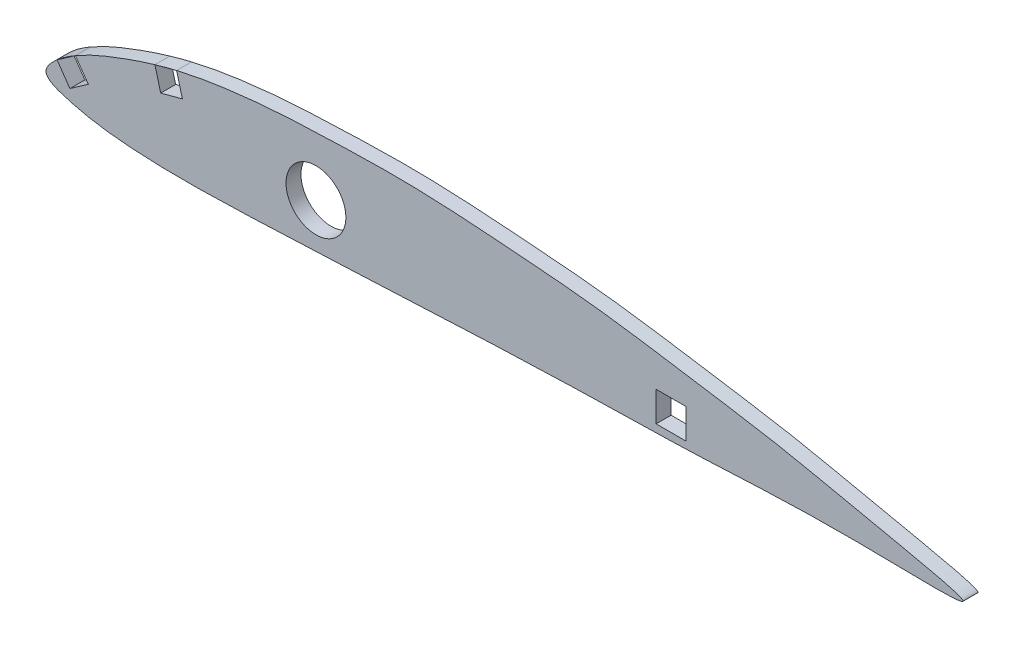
ISO-10303-21;
HEADER;
FILE_DESCRIPTION(('STEP AP214'),'2;1');
FILE_NAME('part.step','',(''),(''),'','','');
FILE_SCHEMA(('AUTOMOTIVE_DESIGN { 1 0 10303 214 1 1 1 1 }'));
ENDSEC;
DATA;
#1=APPLICATION_CONTEXT('core data for automotive mechanical design processes');
#2=APPLICATION_PROTOCOL_DEFINITION('international standard','automotive_design',2000,#1);
#3=PRODUCT_CONTEXT('',#1,'mechanical');
#4=PRODUCT('Part','Part','',(#3));
#5=PRODUCT_RELATED_PRODUCT_CATEGORY('part','',(#4));
#6=PRODUCT_DEFINITION_FORMATION('','',#4);
#7=PRODUCT_DEFINITION_CONTEXT('part definition',#1,'design');
#8=PRODUCT_DEFINITION('design','',#6,#7);
#9=PRODUCT_DEFINITION_SHAPE('','',#8);
#10=(LENGTH_UNIT() NAMED_UNIT(*) SI_UNIT(.MILLI.,.METRE.));
#11=(NAMED_UNIT(*) PLANE_ANGLE_UNIT() SI_UNIT($,.RADIAN.));
#12=(NAMED_UNIT(*) SI_UNIT($,.STERADIAN.) SOLID_ANGLE_UNIT());
#13=UNCERTAINTY_MEASURE_WITH_UNIT(LENGTH_MEASURE(1.E-05),#10,'distance_accuracy_value','');
#14=(GEOMETRIC_REPRESENTATION_CONTEXT(3) GLOBAL_UNCERTAINTY_ASSIGNED_CONTEXT((#13)) GLOBAL_UNIT_ASSIGNED_CONTEXT((#10,
#11,#12)) REPRESENTATION_CONTEXT('',''));
#15=CARTESIAN_POINT('',(0.,0.,0.));
#16=DIRECTION('',(0.,0.,1.));
#17=DIRECTION('',(1.,0.,0.));
#18=AXIS2_PLACEMENT_3D('',#15,#16,#17);
#19=CARTESIAN_POINT('',(0.,0.,0.));
#20=DIRECTION('',(0.,0.,-1.));
#21=DIRECTION('',(-1.,0.,0.));
#22=AXIS2_PLACEMENT_3D('',#19,#20,#21);
#23=PLANE('',#22);
#24=DIRECTION('',(0.,1.,0.));
#25=VECTOR('',#24,1.);
#26=CARTESIAN_POINT('',(129.417,0.,0.));
#27=LINE('',#26,#25);
#28=CARTESIAN_POINT('',(129.417,0.,0.));
#29=VERTEX_POINT('',#28);
#30=CARTESIAN_POINT('',(129.417,6.35,0.));
#31=VERTEX_POINT('',#30);
#32=EDGE_CURVE('E195',#29,#31,#27,.T.);
#33=ORIENTED_EDGE('',*,*,#32,.F.);
#34=DIRECTION('',(-1.,0.,0.));
#35=VECTOR('',#34,1.);
#36=CARTESIAN_POINT('',(0.,0.,0.));
#37=LINE('',#36,#35);
#38=CARTESIAN_POINT('',(135.767,0.,0.));
#39=VERTEX_POINT('',#38);
#40=EDGE_CURVE('E143',#39,#29,#37,.T.);
#41=ORIENTED_EDGE('',*,*,#40,.F.);
#42=DIRECTION('',(0.,-1.,0.));
#43=VECTOR('',#42,1.);
#44=CARTESIAN_POINT('',(135.767,0.,0.));
#45=LINE('',#44,#43);
#46=CARTESIAN_POINT('',(135.767,6.35,0.));
#47=VERTEX_POINT('',#46);
#48=EDGE_CURVE('E131',#47,#39,#45,.T.);
#49=ORIENTED_EDGE('',*,*,#48,.F.);
#50=DIRECTION('',(1.,0.,0.));
#51=VECTOR('',#50,1.);
#52=CARTESIAN_POINT('',(0.,6.35,0.));
#53=LINE('',#52,#51);
#54=EDGE_CURVE('E151',#31,#47,#53,.T.);
#55=ORIENTED_EDGE('',*,*,#54,.F.);
#56=EDGE_LOOP('',(#33,#41,#49,#55));
#57=FACE_BOUND('',#56,.T.);
#58=DIRECTION('',(-0.573576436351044,0.819152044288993,0.));
#59=VECTOR('',#58,1.);
#60=CARTESIAN_POINT('',(3.13682600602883,2.19642921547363,0.));
#61=LINE('',#60,#59);
#62=CARTESIAN_POINT('',(5.07592847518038,-0.572896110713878,0.));
#63=VERTEX_POINT('',#62);
#64=CARTESIAN_POINT('',(2.34427069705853,3.32831550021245,0.));
#65=VERTEX_POINT('',#64);
#66=EDGE_CURVE('E157',#63,#65,#61,.T.);
#67=ORIENTED_EDGE('',*,*,#66,.F.);
#68=DIRECTION('',(-0.819152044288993,-0.573576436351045,0.));
#69=VECTOR('',#68,1.);
#70=CARTESIAN_POINT('',(1.93910246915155,-2.76932532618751,0.));
#71=LINE('',#70,#69);
#72=CARTESIAN_POINT('',(8.97714008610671,2.15876166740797,0.));
#73=VERTEX_POINT('',#72);
#74=EDGE_CURVE('E214',#73,#63,#71,.T.);
#75=ORIENTED_EDGE('',*,*,#74,.F.);
#76=DIRECTION('',(0.573576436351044,-0.819152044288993,0.));
#77=VECTOR('',#76,1.);
#78=CARTESIAN_POINT('',(7.03803761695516,4.92808699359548,0.));
#79=LINE('',#78,#77);
#80=CARTESIAN_POINT('',(6.24548230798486,6.0599732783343,0.));
#81=VERTEX_POINT('',#80);
#82=EDGE_CURVE('E224',#81,#73,#79,.T.);
#83=ORIENTED_EDGE('',*,*,#82,.F.);
#84=CARTESIAN_POINT('',(0.,0.,0.));
#85=CARTESIAN_POINT('',(-0.0535910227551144,1.04071019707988,0.));
#86=CARTESIAN_POINT('',(2.21891608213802,3.37690956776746,0.));
#87=CARTESIAN_POINT('',(5.44657776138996,5.68858581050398,0.));
#88=CARTESIAN_POINT('',(9.62986761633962,7.94124910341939,0.));
#89=CARTESIAN_POINT('',(17.6410211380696,11.1999584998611,0.));
#90=CARTESIAN_POINT('',(27.3590244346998,14.3005312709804,0.));
#91=CARTESIAN_POINT('',(38.8623910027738,16.1401228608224,0.));
#92=CARTESIAN_POINT('',(48.6121616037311,17.1131172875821,0.));
#93=CARTESIAN_POINT('',(61.5900604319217,17.6570218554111,0.));
#94=CARTESIAN_POINT('',(77.8287615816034,18.1175977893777,0.));
#95=CARTESIAN_POINT('',(97.2641868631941,16.7535368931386,0.));
#96=CARTESIAN_POINT('',(116.839934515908,15.228196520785,0.));
#97=CARTESIAN_POINT('',(135.97149229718,12.1634671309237,0.));
#98=CARTESIAN_POINT('',(156.494479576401,9.02600517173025,0.));
#99=CARTESIAN_POINT('',(172.156869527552,5.3413479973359,0.));
#100=CARTESIAN_POINT('',(205.497045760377,-1.26273643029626,0.));
#101=CARTESIAN_POINT('',(162.35826929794,0.256714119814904,0.));
#102=CARTESIAN_POINT('',(143.598235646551,-1.46012727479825,0.));
#103=CARTESIAN_POINT('',(103.100380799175,-2.09853076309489,0.));
#104=CARTESIAN_POINT('',(71.4433442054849,-3.82348710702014,0.));
#105=CARTESIAN_POINT('',(38.8496116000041,-5.24421717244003,0.));
#106=CARTESIAN_POINT('',(22.8315334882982,-5.50686856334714,0.));
#107=CARTESIAN_POINT('',(11.0414504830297,-4.36496331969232,0.));
#108=CARTESIAN_POINT('',(5.03929600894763,-2.99257497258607,0.));
#109=CARTESIAN_POINT('',(0.0735408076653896,-1.42812479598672,0.));
#110=CARTESIAN_POINT('',(0.,0.,0.));
#111=B_SPLINE_CURVE_WITH_KNOTS('',3,(#84,#85,#86,#87,#88,#89,#90,#91,#92,#93,#94,#95,#96,#97,
#98,#99,#100,#101,#102,#103,#104,#105,#106,#107,#108,#109,#110),.UNSPECIFIED.,.T.,.F.,(4,1,1,1,
1,1,1,1,1,1,1,1,1,1,1,1,1,1,1,1,1,1,1,1,4),(0.,0.0105604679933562,0.0182111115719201,
0.0322098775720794,0.0455249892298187,0.0840694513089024,0.10897429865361,0.133649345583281,
0.158232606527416,0.207343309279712,0.25652270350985,0.30582635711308,0.355445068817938,
0.40521420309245,0.4553904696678,0.506006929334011,0.555121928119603,0.653369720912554,
0.702490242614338,0.849938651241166,0.899083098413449,0.948194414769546,0.972905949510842,
0.985508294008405,1.),.UNSPECIFIED.);
#112=CARTESIAN_POINT('',(23.0999646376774,12.8209989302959,0.));
#113=VERTEX_POINT('',#112);
#114=EDGE_CURVE('E170',#81,#113,#111,.T.);
#115=ORIENTED_EDGE('',*,*,#114,.T.);
#116=DIRECTION('',(-0.258819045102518,0.965925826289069,0.));
#117=VECTOR('',#116,1.);
#118=CARTESIAN_POINT('',(24.7578101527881,6.63383523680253,0.));
#119=LINE('',#118,#117);
#120=CARTESIAN_POINT('',(24.3325903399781,8.22077718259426,0.));
#121=VERTEX_POINT('',#120);
#122=EDGE_CURVE('E206',#121,#113,#119,.T.);
#123=ORIENTED_EDGE('',*,*,#122,.F.);
#124=DIRECTION('',(-0.965925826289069,-0.258819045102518,0.));
#125=VECTOR('',#124,1.);
#126=CARTESIAN_POINT('',(-0.42521981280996,1.58694194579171,0.));
#127=LINE('',#126,#125);
#128=CARTESIAN_POINT('',(28.9328120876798,9.453402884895,0.));
#129=VERTEX_POINT('',#128);
#130=EDGE_CURVE('E218',#129,#121,#127,.T.);
#131=ORIENTED_EDGE('',*,*,#130,.F.);
#132=DIRECTION('',(0.258819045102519,-0.965925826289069,0.));
#133=VECTOR('',#132,1.);
#134=CARTESIAN_POINT('',(29.3580319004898,7.86646093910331,0.));
#135=LINE('',#134,#133);
#136=CARTESIAN_POINT('',(27.7001863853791,14.0536246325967,0.));
#137=VERTEX_POINT('',#136);
#138=EDGE_CURVE('E228',#137,#129,#135,.T.);
#139=ORIENTED_EDGE('',*,*,#138,.F.);
#140=EDGE_CURVE('E163',#137,#65,#111,.T.);
#141=ORIENTED_EDGE('',*,*,#140,.T.);
#142=EDGE_LOOP('',(#67,#75,#83,#115,#123,#131,#139,#141));
#143=FACE_BOUND('',#142,.T.);
#144=CARTESIAN_POINT('',(57.26,5.,0.));
#145=DIRECTION('',(0.,0.,-1.));
#146=DIRECTION('',(-1.,0.,0.));
#147=AXIS2_PLACEMENT_3D('',#144,#145,#146);
#148=CIRCLE('',#147,6.35);
#149=CARTESIAN_POINT('',(50.91,5.,0.));
#150=VERTEX_POINT('',#149);
#151=EDGE_CURVE('E201',#150,#150,#148,.T.);
#152=ORIENTED_EDGE('',*,*,#151,.F.);
#153=EDGE_LOOP('',(#152));
#154=FACE_BOUND('',#153,.T.);
#155=ADVANCED_FACE('F44',(#57,#143,#154),#23,.T.);
#156=CARTESIAN_POINT('',(0.,0.,3.175));
#157=DIRECTION('',(0.,0.,-1.));
#158=DIRECTION('',(-1.,0.,0.));
#159=AXIS2_PLACEMENT_3D('',#156,#157,#158);
#160=PLANE('',#159);
#161=DIRECTION('',(1.,0.,0.));
#162=VECTOR('',#161,1.);
#163=CARTESIAN_POINT('',(129.417,0.,3.175));
#164=LINE('',#163,#162);
#165=CARTESIAN_POINT('',(129.417,0.,3.175));
#166=VERTEX_POINT('',#165);
#167=CARTESIAN_POINT('',(135.767,0.,3.175));
#168=VERTEX_POINT('',#167);
#169=EDGE_CURVE('E13',#166,#168,#164,.T.);
#170=ORIENTED_EDGE('',*,*,#169,.F.);
#171=DIRECTION('',(0.,-1.,0.));
#172=VECTOR('',#171,1.);
#173=CARTESIAN_POINT('',(129.417,6.35,3.175));
#174=LINE('',#173,#172);
#175=CARTESIAN_POINT('',(129.417,6.35,3.175));
#176=VERTEX_POINT('',#175);
#177=EDGE_CURVE('E149',#176,#166,#174,.T.);
#178=ORIENTED_EDGE('',*,*,#177,.F.);
#179=DIRECTION('',(-1.,0.,0.));
#180=VECTOR('',#179,1.);
#181=CARTESIAN_POINT('',(129.417,6.35,3.175));
#182=LINE('',#181,#180);
#183=CARTESIAN_POINT('',(135.767,6.35,3.175));
#184=VERTEX_POINT('',#183);
#185=EDGE_CURVE('E142',#184,#176,#182,.T.);
#186=ORIENTED_EDGE('',*,*,#185,.F.);
#187=DIRECTION('',(0.,1.,0.));
#188=VECTOR('',#187,1.);
#189=CARTESIAN_POINT('',(135.767,6.35,3.175));
#190=LINE('',#189,#188);
#191=EDGE_CURVE('E128',#168,#184,#190,.T.);
#192=ORIENTED_EDGE('',*,*,#191,.F.);
#193=EDGE_LOOP('',(#170,#178,#186,#192));
#194=FACE_BOUND('',#193,.T.);
#195=CARTESIAN_POINT('',(57.26,5.,3.175));
#196=DIRECTION('',(0.,0.,1.));
#197=DIRECTION('',(1.,0.,0.));
#198=AXIS2_PLACEMENT_3D('',#195,#196,#197);
#199=CIRCLE('',#198,6.35);
#200=CARTESIAN_POINT('',(63.61,5.,3.175));
#201=VERTEX_POINT('',#200);
#202=EDGE_CURVE('E203',#201,#201,#199,.T.);
#203=ORIENTED_EDGE('',*,*,#202,.F.);
#204=EDGE_LOOP('',(#203));
#205=FACE_BOUND('',#204,.T.);
#206=DIRECTION('',(0.819152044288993,0.573576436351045,0.));
#207=VECTOR('',#206,1.);
#208=CARTESIAN_POINT('',(5.07592847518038,-0.572896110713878,3.175));
#209=LINE('',#208,#207);
#210=CARTESIAN_POINT('',(5.07592847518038,-0.572896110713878,3.175));
#211=VERTEX_POINT('',#210);
#212=CARTESIAN_POINT('',(8.97714008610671,2.15876166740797,3.175));
#213=VERTEX_POINT('',#212);
#214=EDGE_CURVE('E211',#211,#213,#209,.T.);
#215=ORIENTED_EDGE('',*,*,#214,.F.);
#216=DIRECTION('',(0.573576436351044,-0.819152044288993,0.));
#217=VECTOR('',#216,1.);
#218=CARTESIAN_POINT('',(2.34427069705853,3.32831550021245,3.175));
#219=LINE('',#218,#217);
#220=CARTESIAN_POINT('',(2.34427069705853,3.32831550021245,3.175));
#221=VERTEX_POINT('',#220);
#222=EDGE_CURVE('E156',#221,#211,#219,.T.);
#223=ORIENTED_EDGE('',*,*,#222,.F.);
#224=CARTESIAN_POINT('',(0.,0.,3.175));
#225=CARTESIAN_POINT('',(-0.0535910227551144,1.04071019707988,3.175));
#226=CARTESIAN_POINT('',(2.21891608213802,3.37690956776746,3.175));
#227=CARTESIAN_POINT('',(5.44657776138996,5.68858581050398,3.175));
#228=CARTESIAN_POINT('',(9.62986761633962,7.94124910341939,3.175));
#229=CARTESIAN_POINT('',(17.6410211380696,11.1999584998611,3.175));
#230=CARTESIAN_POINT('',(27.3590244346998,14.3005312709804,3.175));
#231=CARTESIAN_POINT('',(38.8623910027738,16.1401228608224,3.175));
#232=CARTESIAN_POINT('',(48.6121616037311,17.1131172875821,3.175));
#233=CARTESIAN_POINT('',(61.5900604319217,17.6570218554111,3.175));
#234=CARTESIAN_POINT('',(77.8287615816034,18.1175977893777,3.175));
#235=CARTESIAN_POINT('',(97.2641868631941,16.7535368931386,3.175));
#236=CARTESIAN_POINT('',(116.839934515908,15.228196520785,3.175));
#237=CARTESIAN_POINT('',(135.97149229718,12.1634671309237,3.175));
#238=CARTESIAN_POINT('',(156.494479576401,9.02600517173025,3.175));
#239=CARTESIAN_POINT('',(172.156869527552,5.3413479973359,3.175));
#240=CARTESIAN_POINT('',(205.497045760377,-1.26273643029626,3.175));
#241=CARTESIAN_POINT('',(162.35826929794,0.256714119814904,3.175));
#242=CARTESIAN_POINT('',(143.598235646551,-1.46012727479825,3.175));
#243=CARTESIAN_POINT('',(103.100380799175,-2.09853076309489,3.175));
#244=CARTESIAN_POINT('',(71.4433442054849,-3.82348710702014,3.175));
#245=CARTESIAN_POINT('',(38.8496116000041,-5.24421717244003,3.175));
#246=CARTESIAN_POINT('',(22.8315334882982,-5.50686856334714,3.175));
#247=CARTESIAN_POINT('',(11.0414504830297,-4.36496331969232,3.175));
#248=CARTESIAN_POINT('',(5.03929600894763,-2.99257497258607,3.175));
#249=CARTESIAN_POINT('',(0.0735408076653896,-1.42812479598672,3.175));
#250=CARTESIAN_POINT('',(0.,0.,3.175));
#251=B_SPLINE_CURVE_WITH_KNOTS('',3,(#224,#225,#226,#227,#228,#229,#230,#231,#232,#233,#234,
#235,#236,#237,#238,#239,#240,#241,#242,#243,#244,#245,#246,#247,#248,#249,#250),.UNSPECIFIED.,
.T.,.F.,(4,1,1,1,1,1,1,1,1,1,1,1,1,1,1,1,1,1,1,1,1,1,1,1,4),(0.,0.0105604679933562,
0.0182111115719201,0.0322098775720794,0.0455249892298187,0.0840694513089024,0.10897429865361,
0.133649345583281,0.158232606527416,0.207343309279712,0.25652270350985,0.30582635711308,
0.355445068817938,0.40521420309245,0.4553904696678,0.506006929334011,0.555121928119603,
0.653369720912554,0.702490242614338,0.849938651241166,0.899083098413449,0.948194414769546,
0.972905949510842,0.985508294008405,1.),.UNSPECIFIED.);
#252=CARTESIAN_POINT('',(27.7001863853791,14.0536246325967,3.175));
#253=VERTEX_POINT('',#252);
#254=EDGE_CURVE('E162',#253,#221,#251,.T.);
#255=ORIENTED_EDGE('',*,*,#254,.F.);
#256=DIRECTION('',(-0.258819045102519,0.965925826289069,0.));
#257=VECTOR('',#256,1.);
#258=CARTESIAN_POINT('',(27.7001863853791,14.0536246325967,3.175));
#259=LINE('',#258,#257);
#260=CARTESIAN_POINT('',(28.9328120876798,9.453402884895,3.175));
#261=VERTEX_POINT('',#260);
#262=EDGE_CURVE('E221',#261,#253,#259,.T.);
#263=ORIENTED_EDGE('',*,*,#262,.F.);
#264=DIRECTION('',(0.965925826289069,0.258819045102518,0.));
#265=VECTOR('',#264,1.);
#266=CARTESIAN_POINT('',(24.3325903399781,8.22077718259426,3.175));
#267=LINE('',#266,#265);
#268=CARTESIAN_POINT('',(24.3325903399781,8.22077718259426,3.175));
#269=VERTEX_POINT('',#268);
#270=EDGE_CURVE('E223',#269,#261,#267,.T.);
#271=ORIENTED_EDGE('',*,*,#270,.F.);
#272=DIRECTION('',(0.258819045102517,-0.965925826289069,0.));
#273=VECTOR('',#272,1.);
#274=CARTESIAN_POINT('',(23.0999646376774,12.8209989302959,3.175));
#275=LINE('',#274,#273);
#276=CARTESIAN_POINT('',(23.0999646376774,12.8209989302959,3.175));
#277=VERTEX_POINT('',#276);
#278=EDGE_CURVE('E231',#277,#269,#275,.T.);
#279=ORIENTED_EDGE('',*,*,#278,.F.);
#280=CARTESIAN_POINT('',(6.24548232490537,6.05997328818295,3.175));
#281=VERTEX_POINT('',#280);
#282=EDGE_CURVE('E161',#281,#277,#251,.T.);
#283=ORIENTED_EDGE('',*,*,#282,.F.);
#284=DIRECTION('',(-0.573576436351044,0.819152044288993,0.));
#285=VECTOR('',#284,1.);
#286=CARTESIAN_POINT('',(6.24548230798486,6.0599732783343,3.175));
#287=LINE('',#286,#285);
#288=EDGE_CURVE('E217',#213,#281,#287,.T.);
#289=ORIENTED_EDGE('',*,*,#288,.F.);
#290=EDGE_LOOP('',(#215,#223,#255,#263,#271,#279,#283,#289));
#291=FACE_BOUND('',#290,.T.);
#292=ADVANCED_FACE('F140',(#194,#205,#291),#160,.F.);
#293=DIRECTION('',(0.,0.,1.));
#294=VECTOR('',#293,1.);
#295=SURFACE_OF_LINEAR_EXTRUSION('',#111,#294);
#296=DIRECTION('',(0.,0.,1.));
#297=VECTOR('',#296,1.);
#298=CARTESIAN_POINT('',(2.34427069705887,3.32831550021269,0.));
#299=LINE('',#298,#297);
#300=EDGE_CURVE('E153',#65,#221,#299,.T.);
#301=ORIENTED_EDGE('',*,*,#300,.F.);
#302=ORIENTED_EDGE('',*,*,#140,.F.);
#303=DIRECTION('',(0.,0.,1.));
#304=VECTOR('',#303,1.);
#305=CARTESIAN_POINT('',(27.7001863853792,14.0536246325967,0.));
#306=LINE('',#305,#304);
#307=EDGE_CURVE('E169',#137,#253,#306,.T.);
#308=ORIENTED_EDGE('',*,*,#307,.T.);
#309=ORIENTED_EDGE('',*,*,#254,.T.);
#310=EDGE_LOOP('',(#301,#302,#308,#309));
#311=FACE_BOUND('',#310,.T.);
#312=ADVANCED_FACE('F179',(#311),#295,.F.);
#313=ORIENTED_EDGE('',*,*,#114,.F.);
#314=DIRECTION('',(0.,0.,1.));
#315=VECTOR('',#314,1.);
#316=CARTESIAN_POINT('',(6.24548230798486,6.0599732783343,0.));
#317=LINE('',#316,#315);
#318=EDGE_CURVE('E158',#81,#281,#317,.T.);
#319=ORIENTED_EDGE('',*,*,#318,.T.);
#320=ORIENTED_EDGE('',*,*,#282,.T.);
#321=DIRECTION('',(0.,0.,1.));
#322=VECTOR('',#321,1.);
#323=CARTESIAN_POINT('',(23.0999646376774,12.8209989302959,0.));
#324=LINE('',#323,#322);
#325=EDGE_CURVE('E47',#113,#277,#324,.T.);
#326=ORIENTED_EDGE('',*,*,#325,.F.);
#327=EDGE_LOOP('',(#313,#319,#320,#326));
#328=FACE_BOUND('',#327,.T.);
#329=ADVANCED_FACE('F175',(#328),#295,.F.);
#330=CARTESIAN_POINT('',(57.26,5.,-6.825));
#331=DIRECTION('',(0.,0.,1.));
#332=DIRECTION('',(1.,0.,0.));
#333=AXIS2_PLACEMENT_3D('',#330,#331,#332);
#334=CYLINDRICAL_SURFACE('',#333,6.35);
#335=ORIENTED_EDGE('',*,*,#151,.T.);
#336=EDGE_LOOP('',(#335));
#337=FACE_BOUND('',#336,.T.);
#338=ORIENTED_EDGE('',*,*,#202,.T.);
#339=EDGE_LOOP('',(#338));
#340=FACE_BOUND('',#339,.T.);
#341=ADVANCED_FACE('F178',(#337,#340),#334,.F.);
#342=CARTESIAN_POINT('',(23.0999646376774,12.8209989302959,-6.825));
#343=DIRECTION('',(-0.965925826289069,-0.258819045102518,0.));
#344=DIRECTION('',(0.258819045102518,-0.965925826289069,0.));
#345=AXIS2_PLACEMENT_3D('',#342,#343,#344);
#346=PLANE('',#345);
#347=ORIENTED_EDGE('',*,*,#122,.T.);
#348=ORIENTED_EDGE('',*,*,#325,.T.);
#349=ORIENTED_EDGE('',*,*,#278,.T.);
#350=DIRECTION('',(0.,0.,1.));
#351=VECTOR('',#350,1.);
#352=CARTESIAN_POINT('',(24.3325903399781,8.22077718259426,-6.825));
#353=LINE('',#352,#351);
#354=EDGE_CURVE('E220',#121,#269,#353,.T.);
#355=ORIENTED_EDGE('',*,*,#354,.F.);
#356=EDGE_LOOP('',(#347,#348,#349,#355));
#357=FACE_BOUND('',#356,.T.);
#358=ADVANCED_FACE('F324',(#357),#346,.F.);
#359=CARTESIAN_POINT('',(27.7001863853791,14.0536246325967,-6.825));
#360=DIRECTION('',(0.965925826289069,0.258819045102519,0.));
#361=DIRECTION('',(-0.258819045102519,0.965925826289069,0.));
#362=AXIS2_PLACEMENT_3D('',#359,#360,#361);
#363=PLANE('',#362);
#364=ORIENTED_EDGE('',*,*,#138,.T.);
#365=DIRECTION('',(0.,0.,1.));
#366=VECTOR('',#365,1.);
#367=CARTESIAN_POINT('',(28.9328120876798,9.453402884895,-6.825));
#368=LINE('',#367,#366);
#369=EDGE_CURVE('E230',#129,#261,#368,.T.);
#370=ORIENTED_EDGE('',*,*,#369,.T.);
#371=ORIENTED_EDGE('',*,*,#262,.T.);
#372=ORIENTED_EDGE('',*,*,#307,.F.);
#373=EDGE_LOOP('',(#364,#370,#371,#372));
#374=FACE_BOUND('',#373,.T.);
#375=ADVANCED_FACE('F314',(#374),#363,.F.);
#376=CARTESIAN_POINT('',(24.3325903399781,8.22077718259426,-6.825));
#377=DIRECTION('',(0.258819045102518,-0.965925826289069,0.));
#378=DIRECTION('',(0.965925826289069,0.258819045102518,0.));
#379=AXIS2_PLACEMENT_3D('',#376,#377,#378);
#380=PLANE('',#379);
#381=ORIENTED_EDGE('',*,*,#130,.T.);
#382=ORIENTED_EDGE('',*,*,#354,.T.);
#383=ORIENTED_EDGE('',*,*,#270,.T.);
#384=ORIENTED_EDGE('',*,*,#369,.F.);
#385=EDGE_LOOP('',(#381,#382,#383,#384));
#386=FACE_BOUND('',#385,.T.);
#387=ADVANCED_FACE('F304',(#386),#380,.F.);
#388=CARTESIAN_POINT('',(2.34427069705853,3.32831550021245,-6.825));
#389=DIRECTION('',(-0.819152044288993,-0.573576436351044,0.));
#390=DIRECTION('',(0.573576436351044,-0.819152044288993,0.));
#391=AXIS2_PLACEMENT_3D('',#388,#389,#390);
#392=PLANE('',#391);
#393=ORIENTED_EDGE('',*,*,#66,.T.);
#394=ORIENTED_EDGE('',*,*,#300,.T.);
#395=ORIENTED_EDGE('',*,*,#222,.T.);
#396=DIRECTION('',(0.,0.,1.));
#397=VECTOR('',#396,1.);
#398=CARTESIAN_POINT('',(5.07592847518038,-0.572896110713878,-6.825));
#399=LINE('',#398,#397);
#400=EDGE_CURVE('E216',#63,#211,#399,.T.);
#401=ORIENTED_EDGE('',*,*,#400,.F.);
#402=EDGE_LOOP('',(#393,#394,#395,#401));
#403=FACE_BOUND('',#402,.T.);
#404=ADVANCED_FACE('F295',(#403),#392,.F.);
#405=CARTESIAN_POINT('',(6.24548230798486,6.0599732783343,-6.825));
#406=DIRECTION('',(0.819152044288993,0.573576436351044,0.));
#407=DIRECTION('',(-0.573576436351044,0.819152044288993,0.));
#408=AXIS2_PLACEMENT_3D('',#405,#406,#407);
#409=PLANE('',#408);
#410=ORIENTED_EDGE('',*,*,#82,.T.);
#411=DIRECTION('',(0.,0.,1.));
#412=VECTOR('',#411,1.);
#413=CARTESIAN_POINT('',(8.97714008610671,2.15876166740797,-6.825));
#414=LINE('',#413,#412);
#415=EDGE_CURVE('E226',#73,#213,#414,.T.);
#416=ORIENTED_EDGE('',*,*,#415,.T.);
#417=ORIENTED_EDGE('',*,*,#288,.T.);
#418=ORIENTED_EDGE('',*,*,#318,.F.);
#419=EDGE_LOOP('',(#410,#416,#417,#418));
#420=FACE_BOUND('',#419,.T.);
#421=ADVANCED_FACE('F260',(#420),#409,.F.);
#422=CARTESIAN_POINT('',(5.07592847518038,-0.572896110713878,-6.825));
#423=DIRECTION('',(0.573576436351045,-0.819152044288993,0.));
#424=DIRECTION('',(0.819152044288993,0.573576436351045,0.));
#425=AXIS2_PLACEMENT_3D('',#422,#423,#424);
#426=PLANE('',#425);
#427=ORIENTED_EDGE('',*,*,#74,.T.);
#428=ORIENTED_EDGE('',*,*,#400,.T.);
#429=ORIENTED_EDGE('',*,*,#214,.T.);
#430=ORIENTED_EDGE('',*,*,#415,.F.);
#431=EDGE_LOOP('',(#427,#428,#429,#430));
#432=FACE_BOUND('',#431,.T.);
#433=ADVANCED_FACE('F255',(#432),#426,.F.);
#434=CARTESIAN_POINT('',(129.417,6.35,-6.825));
#435=DIRECTION('',(-1.,0.,0.));
#436=DIRECTION('',(0.,0.,1.));
#437=AXIS2_PLACEMENT_3D('',#434,#435,#436);
#438=PLANE('',#437);
#439=ORIENTED_EDGE('',*,*,#32,.T.);
#440=DIRECTION('',(0.,0.,1.));
#441=VECTOR('',#440,1.);
#442=CARTESIAN_POINT('',(129.417,6.35,-6.825));
#443=LINE('',#442,#441);
#444=EDGE_CURVE('E152',#31,#176,#443,.T.);
#445=ORIENTED_EDGE('',*,*,#444,.T.);
#446=ORIENTED_EDGE('',*,*,#177,.T.);
#447=DIRECTION('',(0.,0.,1.));
#448=VECTOR('',#447,1.);
#449=CARTESIAN_POINT('',(129.417,0.,-6.825));
#450=LINE('',#449,#448);
#451=EDGE_CURVE('E53',#29,#166,#450,.T.);
#452=ORIENTED_EDGE('',*,*,#451,.F.);
#453=EDGE_LOOP('',(#439,#445,#446,#452));
#454=FACE_BOUND('',#453,.T.);
#455=ADVANCED_FACE('F249',(#454),#438,.F.);
#456=CARTESIAN_POINT('',(129.417,6.35,-6.825));
#457=DIRECTION('',(0.,1.,0.));
#458=DIRECTION('',(0.,0.,1.));
#459=AXIS2_PLACEMENT_3D('',#456,#457,#458);
#460=PLANE('',#459);
#461=ORIENTED_EDGE('',*,*,#54,.T.);
#462=DIRECTION('',(0.,0.,1.));
#463=VECTOR('',#462,1.);
#464=CARTESIAN_POINT('',(135.767,6.35,-6.825));
#465=LINE('',#464,#463);
#466=EDGE_CURVE('E123',#47,#184,#465,.T.);
#467=ORIENTED_EDGE('',*,*,#466,.T.);
#468=ORIENTED_EDGE('',*,*,#185,.T.);
#469=ORIENTED_EDGE('',*,*,#444,.F.);
#470=EDGE_LOOP('',(#461,#467,#468,#469));
#471=FACE_BOUND('',#470,.T.);
#472=ADVANCED_FACE('F181',(#471),#460,.F.);
#473=CARTESIAN_POINT('',(135.767,6.35,-6.825));
#474=DIRECTION('',(1.,0.,0.));
#475=DIRECTION('',(0.,0.,-1.));
#476=AXIS2_PLACEMENT_3D('',#473,#474,#475);
#477=PLANE('',#476);
#478=ORIENTED_EDGE('',*,*,#48,.T.);
#479=DIRECTION('',(0.,0.,1.));
#480=VECTOR('',#479,1.);
#481=CARTESIAN_POINT('',(135.767,0.,-6.825));
#482=LINE('',#481,#480);
#483=EDGE_CURVE('E61',#39,#168,#482,.T.);
#484=ORIENTED_EDGE('',*,*,#483,.T.);
#485=ORIENTED_EDGE('',*,*,#191,.T.);
#486=ORIENTED_EDGE('',*,*,#466,.F.);
#487=EDGE_LOOP('',(#478,#484,#485,#486));
#488=FACE_BOUND('',#487,.T.);
#489=ADVANCED_FACE('F126',(#488),#477,.F.);
#490=CARTESIAN_POINT('',(129.417,0.,-6.825));
#491=DIRECTION('',(0.,-1.,0.));
#492=DIRECTION('',(0.,0.,-1.));
#493=AXIS2_PLACEMENT_3D('',#490,#491,#492);
#494=PLANE('',#493);
#495=ORIENTED_EDGE('',*,*,#40,.T.);
#496=ORIENTED_EDGE('',*,*,#451,.T.);
#497=ORIENTED_EDGE('',*,*,#169,.T.);
#498=ORIENTED_EDGE('',*,*,#483,.F.);
#499=EDGE_LOOP('',(#495,#496,#497,#498));
#500=FACE_BOUND('',#499,.T.);
#501=ADVANCED_FACE('F136',(#500),#494,.F.);
#502=CLOSED_SHELL('',(#155,#292,#312,#329,#341,#358,#375,#387,#404,#421,#433,#455,#472,#489,#501));
#503=MANIFOLD_SOLID_BREP('B2',#502);
#504=CARTESIAN_POINT('',(0.,0.,0.));
#505=CARTESIAN_POINT('',(-0.0535910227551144,1.04071019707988,0.));
#506=CARTESIAN_POINT('',(2.21891608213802,3.37690956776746,0.));
#507=CARTESIAN_POINT('',(5.44657776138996,5.68858581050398,0.));
#508=CARTESIAN_POINT('',(9.62986761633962,7.94124910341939,0.));
#509=CARTESIAN_POINT('',(17.6410211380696,11.1999584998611,0.));
#510=CARTESIAN_POINT('',(27.3590244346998,14.3005312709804,0.));
#511=CARTESIAN_POINT('',(38.8623910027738,16.1401228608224,0.));
#512=CARTESIAN_POINT('',(48.6121616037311,17.1131172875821,0.));
#513=CARTESIAN_POINT('',(61.5900604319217,17.6570218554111,0.));
#514=CARTESIAN_POINT('',(77.8287615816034,18.1175977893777,0.));
#515=CARTESIAN_POINT('',(97.2641868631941,16.7535368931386,0.));
#516=CARTESIAN_POINT('',(116.839934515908,15.228196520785,0.));
#517=CARTESIAN_POINT('',(135.97149229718,12.1634671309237,0.));
#518=CARTESIAN_POINT('',(156.494479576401,9.02600517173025,0.));
#519=CARTESIAN_POINT('',(172.156869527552,5.3413479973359,0.));
#520=CARTESIAN_POINT('',(205.497045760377,-1.26273643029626,0.));
#521=CARTESIAN_POINT('',(162.35826929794,0.256714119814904,0.));
#522=CARTESIAN_POINT('',(143.598235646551,-1.46012727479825,0.));
#523=CARTESIAN_POINT('',(103.100380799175,-2.09853076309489,0.));
#524=CARTESIAN_POINT('',(71.4433442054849,-3.82348710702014,0.));
#525=CARTESIAN_POINT('',(38.8496116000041,-5.24421717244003,0.));
#526=CARTESIAN_POINT('',(22.8315334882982,-5.50686856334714,0.));
#527=CARTESIAN_POINT('',(11.0414504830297,-4.36496331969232,0.));
#528=CARTESIAN_POINT('',(5.03929600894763,-2.99257497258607,0.));
#529=CARTESIAN_POINT('',(0.0735408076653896,-1.42812479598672,0.));
#530=CARTESIAN_POINT('',(0.,0.,0.));
#531=B_SPLINE_CURVE_WITH_KNOTS('',3,(#504,#505,#506,#507,#508,#509,#510,#511,#512,#513,#514,
#515,#516,#517,#518,#519,#520,#521,#522,#523,#524,#525,#526,#527,#528,#529,#530),.UNSPECIFIED.,
.T.,.F.,(4,1,1,1,1,1,1,1,1,1,1,1,1,1,1,1,1,1,1,1,1,1,1,1,4),(0.,0.0105604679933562,
0.0182111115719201,0.0322098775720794,0.0455249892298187,0.0840694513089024,0.10897429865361,
0.133649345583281,0.158232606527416,0.207343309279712,0.25652270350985,0.30582635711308,
0.355445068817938,0.40521420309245,0.4553904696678,0.506006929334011,0.555121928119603,
0.653369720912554,0.702490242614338,0.849938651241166,0.899083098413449,0.948194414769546,
0.972905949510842,0.985508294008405,1.),.UNSPECIFIED.);
#532=DIRECTION('',(0.,0.,1.));
#533=VECTOR('',#532,1.);
#534=SURFACE_OF_LINEAR_EXTRUSION('',#531,#533);
#535=CARTESIAN_POINT('',(23.0999646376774,12.8209989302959,0.));
#536=VERTEX_POINT('',#535);
#537=CARTESIAN_POINT('',(27.7001863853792,14.0536246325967,0.));
#538=VERTEX_POINT('',#537);
#539=EDGE_CURVE('E447',#536,#538,#531,.T.);
#540=ORIENTED_EDGE('',*,*,#539,.F.);
#541=DIRECTION('',(0.,0.,1.));
#542=VECTOR('',#541,1.);
#543=CARTESIAN_POINT('',(23.0999646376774,12.8209989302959,0.));
#544=LINE('',#543,#542);
#545=CARTESIAN_POINT('',(23.0999646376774,12.8209989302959,3.175));
#546=VERTEX_POINT('',#545);
#547=EDGE_CURVE('E434',#536,#546,#544,.T.);
#548=ORIENTED_EDGE('',*,*,#547,.T.);
#549=CARTESIAN_POINT('',(0.,0.,3.175));
#550=CARTESIAN_POINT('',(-0.0535910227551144,1.04071019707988,3.175));
#551=CARTESIAN_POINT('',(2.21891608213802,3.37690956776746,3.175));
#552=CARTESIAN_POINT('',(5.44657776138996,5.68858581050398,3.175));
#553=CARTESIAN_POINT('',(9.62986761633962,7.94124910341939,3.175));
#554=CARTESIAN_POINT('',(17.6410211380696,11.1999584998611,3.175));
#555=CARTESIAN_POINT('',(27.3590244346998,14.3005312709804,3.175));
#556=CARTESIAN_POINT('',(38.8623910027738,16.1401228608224,3.175));
#557=CARTESIAN_POINT('',(48.6121616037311,17.1131172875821,3.175));
#558=CARTESIAN_POINT('',(61.5900604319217,17.6570218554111,3.175));
#559=CARTESIAN_POINT('',(77.8287615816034,18.1175977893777,3.175));
#560=CARTESIAN_POINT('',(97.2641868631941,16.7535368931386,3.175));
#561=CARTESIAN_POINT('',(116.839934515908,15.228196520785,3.175));
#562=CARTESIAN_POINT('',(135.97149229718,12.1634671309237,3.175));
#563=CARTESIAN_POINT('',(156.494479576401,9.02600517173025,3.175));
#564=CARTESIAN_POINT('',(172.156869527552,5.3413479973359,3.175));
#565=CARTESIAN_POINT('',(205.497045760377,-1.26273643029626,3.175));
#566=CARTESIAN_POINT('',(162.35826929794,0.256714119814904,3.175));
#567=CARTESIAN_POINT('',(143.598235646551,-1.46012727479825,3.175));
#568=CARTESIAN_POINT('',(103.100380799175,-2.09853076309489,3.175));
#569=CARTESIAN_POINT('',(71.4433442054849,-3.82348710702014,3.175));
#570=CARTESIAN_POINT('',(38.8496116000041,-5.24421717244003,3.175));
#571=CARTESIAN_POINT('',(22.8315334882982,-5.50686856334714,3.175));
#572=CARTESIAN_POINT('',(11.0414504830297,-4.36496331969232,3.175));
#573=CARTESIAN_POINT('',(5.03929600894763,-2.99257497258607,3.175));
#574=CARTESIAN_POINT('',(0.0735408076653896,-1.42812479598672,3.175));
#575=CARTESIAN_POINT('',(0.,0.,3.175));
#576=B_SPLINE_CURVE_WITH_KNOTS('',3,(#549,#550,#551,#552,#553,#554,#555,#556,#557,#558,#559,
#560,#561,#562,#563,#564,#565,#566,#567,#568,#569,#570,#571,#572,#573,#574,#575),.UNSPECIFIED.,
.T.,.F.,(4,1,1,1,1,1,1,1,1,1,1,1,1,1,1,1,1,1,1,1,1,1,1,1,4),(0.,0.0105604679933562,
0.0182111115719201,0.0322098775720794,0.0455249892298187,0.0840694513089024,0.10897429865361,
0.133649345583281,0.158232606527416,0.207343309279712,0.25652270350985,0.30582635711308,
0.355445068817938,0.40521420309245,0.4553904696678,0.506006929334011,0.555121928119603,
0.653369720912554,0.702490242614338,0.849938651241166,0.899083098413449,0.948194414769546,
0.972905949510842,0.985508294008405,1.),.UNSPECIFIED.);
#577=CARTESIAN_POINT('',(27.7001863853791,14.0536246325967,3.175));
#578=VERTEX_POINT('',#577);
#579=EDGE_CURVE('E419',#546,#578,#576,.T.);
#580=ORIENTED_EDGE('',*,*,#579,.T.);
#581=DIRECTION('',(0.,0.,1.));
#582=VECTOR('',#581,1.);
#583=CARTESIAN_POINT('',(27.7001863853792,14.0536246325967,0.));
#584=LINE('',#583,#582);
#585=EDGE_CURVE('E427',#538,#578,#584,.T.);
#586=ORIENTED_EDGE('',*,*,#585,.F.);
#587=EDGE_LOOP('',(#540,#548,#580,#586));
#588=FACE_BOUND('',#587,.T.);
#589=ADVANCED_FACE('F415',(#588),#534,.F.);
#590=CARTESIAN_POINT('',(0.,0.,3.175));
#591=DIRECTION('',(0.,0.,-1.));
#592=DIRECTION('',(-1.,0.,0.));
#593=AXIS2_PLACEMENT_3D('',#590,#591,#592);
#594=PLANE('',#593);
#595=ORIENTED_EDGE('',*,*,#579,.F.);
#596=DIRECTION('',(-0.965925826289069,-0.258819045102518,0.));
#597=VECTOR('',#596,1.);
#598=CARTESIAN_POINT('',(23.0999646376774,12.8209989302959,3.175));
#599=LINE('',#598,#597);
#600=EDGE_CURVE('E42',#578,#546,#599,.T.);
#601=ORIENTED_EDGE('',*,*,#600,.F.);
#602=EDGE_LOOP('',(#595,#601));
#603=FACE_BOUND('',#602,.T.);
#604=ADVANCED_FACE('F462',(#603),#594,.F.);
#605=CARTESIAN_POINT('',(0.,0.,0.));
#606=DIRECTION('',(0.,0.,-1.));
#607=DIRECTION('',(-1.,0.,0.));
#608=AXIS2_PLACEMENT_3D('',#605,#606,#607);
#609=PLANE('',#608);
#610=DIRECTION('',(0.965925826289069,0.258819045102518,0.));
#611=VECTOR('',#610,1.);
#612=CARTESIAN_POINT('',(-1.6578455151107,6.1871636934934,0.));
#613=LINE('',#612,#611);
#614=EDGE_CURVE('E441',#536,#538,#613,.T.);
#615=ORIENTED_EDGE('',*,*,#614,.F.);
#616=ORIENTED_EDGE('',*,*,#539,.T.);
#617=EDGE_LOOP('',(#615,#616));
#618=FACE_BOUND('',#617,.T.);
#619=ADVANCED_FACE('F417',(#618),#609,.T.);
#620=CARTESIAN_POINT('',(23.0999646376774,12.8209989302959,-6.825));
#621=DIRECTION('',(-0.258819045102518,0.965925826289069,0.));
#622=DIRECTION('',(-0.965925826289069,-0.258819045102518,0.));
#623=AXIS2_PLACEMENT_3D('',#620,#621,#622);
#624=PLANE('',#623);
#625=ORIENTED_EDGE('',*,*,#614,.T.);
#626=ORIENTED_EDGE('',*,*,#585,.T.);
#627=ORIENTED_EDGE('',*,*,#600,.T.);
#628=ORIENTED_EDGE('',*,*,#547,.F.);
#629=EDGE_LOOP('',(#625,#626,#627,#628));
#630=FACE_BOUND('',#629,.T.);
#631=ADVANCED_FACE('F443',(#630),#624,.F.);
#632=CLOSED_SHELL('',(#589,#604,#619,#631));
#633=MANIFOLD_SOLID_BREP('B7',#632);
#634=CARTESIAN_POINT('',(0.,0.,0.));
#635=CARTESIAN_POINT('',(-0.0535910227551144,1.04071019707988,0.));
#636=CARTESIAN_POINT('',(2.21891608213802,3.37690956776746,0.));
#637=CARTESIAN_POINT('',(5.44657776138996,5.68858581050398,0.));
#638=CARTESIAN_POINT('',(9.62986761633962,7.94124910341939,0.));
#639=CARTESIAN_POINT('',(17.6410211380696,11.1999584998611,0.));
#640=CARTESIAN_POINT('',(27.3590244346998,14.3005312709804,0.));
#641=CARTESIAN_POINT('',(38.8623910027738,16.1401228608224,0.));
#642=CARTESIAN_POINT('',(48.6121616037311,17.1131172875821,0.));
#643=CARTESIAN_POINT('',(61.5900604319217,17.6570218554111,0.));
#644=CARTESIAN_POINT('',(77.8287615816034,18.1175977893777,0.));
#645=CARTESIAN_POINT('',(97.2641868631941,16.7535368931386,0.));
#646=CARTESIAN_POINT('',(116.839934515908,15.228196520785,0.));
#647=CARTESIAN_POINT('',(135.97149229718,12.1634671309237,0.));
#648=CARTESIAN_POINT('',(156.494479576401,9.02600517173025,0.));
#649=CARTESIAN_POINT('',(172.156869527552,5.3413479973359,0.));
#650=CARTESIAN_POINT('',(205.497045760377,-1.26273643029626,0.));
#651=CARTESIAN_POINT('',(162.35826929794,0.256714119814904,0.));
#652=CARTESIAN_POINT('',(143.598235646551,-1.46012727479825,0.));
#653=CARTESIAN_POINT('',(103.100380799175,-2.09853076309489,0.));
#654=CARTESIAN_POINT('',(71.4433442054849,-3.82348710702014,0.));
#655=CARTESIAN_POINT('',(38.8496116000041,-5.24421717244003,0.));
#656=CARTESIAN_POINT('',(22.8315334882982,-5.50686856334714,0.));
#657=CARTESIAN_POINT('',(11.0414504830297,-4.36496331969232,0.));
#658=CARTESIAN_POINT('',(5.03929600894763,-2.99257497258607,0.));
#659=CARTESIAN_POINT('',(0.0735408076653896,-1.42812479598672,0.));
#660=CARTESIAN_POINT('',(0.,0.,0.));
#661=B_SPLINE_CURVE_WITH_KNOTS('',3,(#634,#635,#636,#637,#638,#639,#640,#641,#642,#643,#644,
#645,#646,#647,#648,#649,#650,#651,#652,#653,#654,#655,#656,#657,#658,#659,#660),.UNSPECIFIED.,
.T.,.F.,(4,1,1,1,1,1,1,1,1,1,1,1,1,1,1,1,1,1,1,1,1,1,1,1,4),(0.,0.0105604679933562,
0.0182111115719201,0.0322098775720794,0.0455249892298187,0.0840694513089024,0.10897429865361,
0.133649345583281,0.158232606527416,0.207343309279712,0.25652270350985,0.30582635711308,
0.355445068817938,0.40521420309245,0.4553904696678,0.506006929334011,0.555121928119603,
0.653369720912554,0.702490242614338,0.849938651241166,0.899083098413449,0.948194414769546,
0.972905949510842,0.985508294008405,1.),.UNSPECIFIED.);
#662=DIRECTION('',(0.,0.,1.));
#663=VECTOR('',#662,1.);
#664=SURFACE_OF_LINEAR_EXTRUSION('',#661,#663);
#665=CARTESIAN_POINT('',(2.34427069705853,3.32831550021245,0.));
#666=VERTEX_POINT('',#665);
#667=CARTESIAN_POINT('',(6.24548230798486,6.05997327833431,0.));
#668=VERTEX_POINT('',#667);
#669=EDGE_CURVE('E529',#666,#668,#661,.T.);
#670=ORIENTED_EDGE('',*,*,#669,.F.);
#671=DIRECTION('',(0.,0.,1.));
#672=VECTOR('',#671,1.);
#673=CARTESIAN_POINT('',(2.34427069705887,3.32831550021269,0.));
#674=LINE('',#673,#672);
#675=CARTESIAN_POINT('',(2.34427069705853,3.32831550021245,3.175));
#676=VERTEX_POINT('',#675);
#677=EDGE_CURVE('E413',#666,#676,#674,.T.);
#678=ORIENTED_EDGE('',*,*,#677,.T.);
#679=CARTESIAN_POINT('',(0.,0.,3.175));
#680=CARTESIAN_POINT('',(-0.0535910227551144,1.04071019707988,3.175));
#681=CARTESIAN_POINT('',(2.21891608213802,3.37690956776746,3.175));
#682=CARTESIAN_POINT('',(5.44657776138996,5.68858581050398,3.175));
#683=CARTESIAN_POINT('',(9.62986761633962,7.94124910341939,3.175));
#684=CARTESIAN_POINT('',(17.6410211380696,11.1999584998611,3.175));
#685=CARTESIAN_POINT('',(27.3590244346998,14.3005312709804,3.175));
#686=CARTESIAN_POINT('',(38.8623910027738,16.1401228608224,3.175));
#687=CARTESIAN_POINT('',(48.6121616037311,17.1131172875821,3.175));
#688=CARTESIAN_POINT('',(61.5900604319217,17.6570218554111,3.175));
#689=CARTESIAN_POINT('',(77.8287615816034,18.1175977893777,3.175));
#690=CARTESIAN_POINT('',(97.2641868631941,16.7535368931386,3.175));
#691=CARTESIAN_POINT('',(116.839934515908,15.228196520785,3.175));
#692=CARTESIAN_POINT('',(135.97149229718,12.1634671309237,3.175));
#693=CARTESIAN_POINT('',(156.494479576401,9.02600517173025,3.175));
#694=CARTESIAN_POINT('',(172.156869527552,5.3413479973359,3.175));
#695=CARTESIAN_POINT('',(205.497045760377,-1.26273643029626,3.175));
#696=CARTESIAN_POINT('',(162.35826929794,0.256714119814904,3.175));
#697=CARTESIAN_POINT('',(143.598235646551,-1.46012727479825,3.175));
#698=CARTESIAN_POINT('',(103.100380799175,-2.09853076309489,3.175));
#699=CARTESIAN_POINT('',(71.4433442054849,-3.82348710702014,3.175));
#700=CARTESIAN_POINT('',(38.8496116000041,-5.24421717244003,3.175));
#701=CARTESIAN_POINT('',(22.8315334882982,-5.50686856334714,3.175));
#702=CARTESIAN_POINT('',(11.0414504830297,-4.36496331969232,3.175));
#703=CARTESIAN_POINT('',(5.03929600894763,-2.99257497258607,3.175));
#704=CARTESIAN_POINT('',(0.0735408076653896,-1.42812479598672,3.175));
#705=CARTESIAN_POINT('',(0.,0.,3.175));
#706=B_SPLINE_CURVE_WITH_KNOTS('',3,(#679,#680,#681,#682,#683,#684,#685,#686,#687,#688,#689,
#690,#691,#692,#693,#694,#695,#696,#697,#698,#699,#700,#701,#702,#703,#704,#705),.UNSPECIFIED.,
.T.,.F.,(4,1,1,1,1,1,1,1,1,1,1,1,1,1,1,1,1,1,1,1,1,1,1,1,4),(0.,0.0105604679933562,
0.0182111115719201,0.0322098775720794,0.0455249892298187,0.0840694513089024,0.10897429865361,
0.133649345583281,0.158232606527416,0.207343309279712,0.25652270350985,0.30582635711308,
0.355445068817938,0.40521420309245,0.4553904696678,0.506006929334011,0.555121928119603,
0.653369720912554,0.702490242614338,0.849938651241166,0.899083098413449,0.948194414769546,
0.972905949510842,0.985508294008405,1.),.UNSPECIFIED.);
#707=CARTESIAN_POINT('',(6.24548230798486,6.0599732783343,3.175));
#708=VERTEX_POINT('',#707);
#709=EDGE_CURVE('E527',#676,#708,#706,.T.);
#710=ORIENTED_EDGE('',*,*,#709,.T.);
#711=DIRECTION('',(0.,0.,1.));
#712=VECTOR('',#711,1.);
#713=CARTESIAN_POINT('',(6.24548230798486,6.0599732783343,0.));
#714=LINE('',#713,#712);
#715=EDGE_CURVE('E505',#668,#708,#714,.T.);
#716=ORIENTED_EDGE('',*,*,#715,.F.);
#717=EDGE_LOOP('',(#670,#678,#710,#716));
#718=FACE_BOUND('',#717,.T.);
#719=ADVANCED_FACE('F497',(#718),#664,.F.);
#720=CARTESIAN_POINT('',(0.,0.,3.175));
#721=DIRECTION('',(0.,0.,-1.));
#722=DIRECTION('',(-1.,0.,0.));
#723=AXIS2_PLACEMENT_3D('',#720,#721,#722);
#724=PLANE('',#723);
#725=ORIENTED_EDGE('',*,*,#709,.F.);
#726=DIRECTION('',(-0.819152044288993,-0.573576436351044,0.));
#727=VECTOR('',#726,1.);
#728=CARTESIAN_POINT('',(2.34427069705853,3.32831550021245,3.175));
#729=LINE('',#728,#727);
#730=EDGE_CURVE('E520',#708,#676,#729,.T.);
#731=ORIENTED_EDGE('',*,*,#730,.F.);
#732=EDGE_LOOP('',(#725,#731));
#733=FACE_BOUND('',#732,.T.);
#734=ADVANCED_FACE('F531',(#733),#724,.F.);
#735=CARTESIAN_POINT('',(0.,0.,0.));
#736=DIRECTION('',(0.,0.,-1.));
#737=DIRECTION('',(-1.,0.,0.));
#738=AXIS2_PLACEMENT_3D('',#735,#736,#737);
#739=PLANE('',#738);
#740=DIRECTION('',(0.819152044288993,0.573576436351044,0.));
#741=VECTOR('',#740,1.);
#742=CARTESIAN_POINT('',(-0.7925553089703,1.13188628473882,0.));
#743=LINE('',#742,#741);
#744=EDGE_CURVE('E524',#666,#668,#743,.T.);
#745=ORIENTED_EDGE('',*,*,#744,.F.);
#746=ORIENTED_EDGE('',*,*,#669,.T.);
#747=EDGE_LOOP('',(#745,#746));
#748=FACE_BOUND('',#747,.T.);
#749=ADVANCED_FACE('F499',(#748),#739,.T.);
#750=CARTESIAN_POINT('',(2.34427069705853,3.32831550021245,-6.825));
#751=DIRECTION('',(-0.573576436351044,0.819152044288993,0.));
#752=DIRECTION('',(-0.819152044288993,-0.573576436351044,0.));
#753=AXIS2_PLACEMENT_3D('',#750,#751,#752);
#754=PLANE('',#753);
#755=ORIENTED_EDGE('',*,*,#744,.T.);
#756=ORIENTED_EDGE('',*,*,#715,.T.);
#757=ORIENTED_EDGE('',*,*,#730,.T.);
#758=ORIENTED_EDGE('',*,*,#677,.F.);
#759=EDGE_LOOP('',(#755,#756,#757,#758));
#760=FACE_BOUND('',#759,.T.);
#761=ADVANCED_FACE('F521',(#760),#754,.F.);
#762=CLOSED_SHELL('',(#719,#734,#749,#761));
#763=MANIFOLD_SOLID_BREP('B36',#762);
#764=ADVANCED_BREP_SHAPE_REPRESENTATION('',(#18,#503,#633,#763),#14);
#765=SHAPE_DEFINITION_REPRESENTATION(#9,#764);
ENDSEC;
END-ISO-10303-21;
